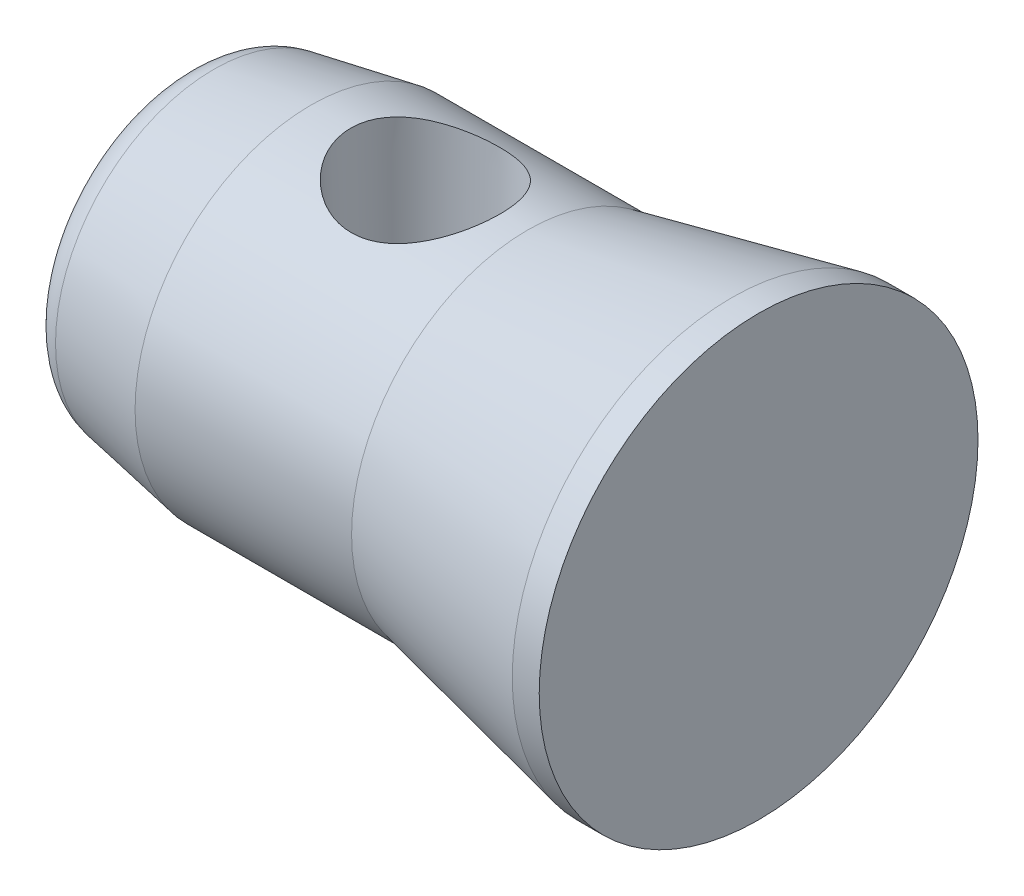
ISO-10303-21;
HEADER;
FILE_DESCRIPTION(('STEP AP214'),'2;1');
FILE_NAME('part.step','',(''),(''),'','','');
FILE_SCHEMA(('AUTOMOTIVE_DESIGN { 1 0 10303 214 1 1 1 1 }'));
ENDSEC;
DATA;
#1=APPLICATION_CONTEXT('core data for automotive mechanical design processes');
#2=APPLICATION_PROTOCOL_DEFINITION('international standard','automotive_design',2000,#1);
#3=PRODUCT_CONTEXT('',#1,'mechanical');
#4=PRODUCT('Part','Part','',(#3));
#5=PRODUCT_RELATED_PRODUCT_CATEGORY('part','',(#4));
#6=PRODUCT_DEFINITION_FORMATION('','',#4);
#7=PRODUCT_DEFINITION_CONTEXT('part definition',#1,'design');
#8=PRODUCT_DEFINITION('design','',#6,#7);
#9=PRODUCT_DEFINITION_SHAPE('','',#8);
#10=(LENGTH_UNIT() NAMED_UNIT(*) SI_UNIT(.MILLI.,.METRE.));
#11=(NAMED_UNIT(*) PLANE_ANGLE_UNIT() SI_UNIT($,.RADIAN.));
#12=(NAMED_UNIT(*) SI_UNIT($,.STERADIAN.) SOLID_ANGLE_UNIT());
#13=UNCERTAINTY_MEASURE_WITH_UNIT(LENGTH_MEASURE(1.E-05),#10,'distance_accuracy_value','');
#14=(GEOMETRIC_REPRESENTATION_CONTEXT(3) GLOBAL_UNCERTAINTY_ASSIGNED_CONTEXT((#13)) GLOBAL_UNIT_ASSIGNED_CONTEXT((#10,
#11,#12)) REPRESENTATION_CONTEXT('',''));
#15=CARTESIAN_POINT('',(0.,0.,0.));
#16=DIRECTION('',(0.,0.,1.));
#17=DIRECTION('',(1.,0.,0.));
#18=AXIS2_PLACEMENT_3D('',#15,#16,#17);
#19=CARTESIAN_POINT('',(-33.874,0.,0.));
#20=DIRECTION('',(1.,0.,0.));
#21=DIRECTION('',(0.,0.,-1.));
#22=AXIS2_PLACEMENT_3D('',#19,#20,#21);
#23=CONICAL_SURFACE('',#22,13.903,0.179210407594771);
#24=CARTESIAN_POINT('',(-41.5497580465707,0.,0.));
#25=DIRECTION('',(-1.,0.,0.));
#26=DIRECTION('',(0.,0.,1.));
#27=AXIS2_PLACEMENT_3D('',#24,#25,#26);
#28=CIRCLE('',#27,12.5125064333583);
#29=CARTESIAN_POINT('',(-41.5497580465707,0.,12.5125064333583));
#30=VERTEX_POINT('',#29);
#31=EDGE_CURVE('E96',#30,#30,#28,.T.);
#32=ORIENTED_EDGE('',*,*,#31,.F.);
#33=EDGE_LOOP('',(#32));
#34=FACE_BOUND('',#33,.T.);
#35=CARTESIAN_POINT('',(-33.874,0.,0.));
#36=DIRECTION('',(-1.,0.,0.));
#37=DIRECTION('',(0.,0.,1.));
#38=AXIS2_PLACEMENT_3D('',#35,#36,#37);
#39=CIRCLE('',#38,13.903);
#40=CARTESIAN_POINT('',(-33.874,0.,13.903));
#41=VERTEX_POINT('',#40);
#42=EDGE_CURVE('E10',#41,#41,#39,.T.);
#43=ORIENTED_EDGE('',*,*,#42,.T.);
#44=EDGE_LOOP('',(#43));
#45=FACE_BOUND('',#44,.T.);
#46=ADVANCED_FACE('F32',(#34,#45),#23,.T.);
#47=CARTESIAN_POINT('',(-110.,0.,0.));
#48=DIRECTION('',(-1.,0.,0.));
#49=DIRECTION('',(0.,0.,1.));
#50=AXIS2_PLACEMENT_3D('',#47,#48,#49);
#51=CYLINDRICAL_SURFACE('',#50,13.903);
#52=CARTESIAN_POINT('',(-28.1991654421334,-13.3648858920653,-3.8305657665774));
#53=CARTESIAN_POINT('',(-28.413769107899,-13.419504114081,-3.63999457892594));
#54=CARTESIAN_POINT('',(-28.6120570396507,-13.4748615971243,-3.43141943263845));
#55=CARTESIAN_POINT('',(-28.9713312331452,-13.5811070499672,-2.98326657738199));
#56=CARTESIAN_POINT('',(-29.1323246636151,-13.6319958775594,-2.74369484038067));
#57=CARTESIAN_POINT('',(-29.4126989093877,-13.7239453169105,-2.23888655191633));
#58=CARTESIAN_POINT('',(-29.5319955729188,-13.7649860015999,-1.97359946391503));
#59=CARTESIAN_POINT('',(-29.7243766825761,-13.8325328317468,-1.4250164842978));
#60=CARTESIAN_POINT('',(-29.7974767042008,-13.8590438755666,-1.14172669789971));
#61=CARTESIAN_POINT('',(-29.8926854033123,-13.8937950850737,-0.576903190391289));
#62=CARTESIAN_POINT('',(-29.9166543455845,-13.9027013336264,-0.295724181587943));
#63=CARTESIAN_POINT('',(-29.9182328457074,-13.9032835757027,0.26675457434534));
#64=CARTESIAN_POINT('',(-29.8958505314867,-13.8949625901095,0.548054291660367));
#65=CARTESIAN_POINT('',(-29.807218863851,-13.8625893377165,1.09268666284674));
#66=CARTESIAN_POINT('',(-29.7425023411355,-13.8390871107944,1.35630458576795));
#67=CARTESIAN_POINT('',(-29.5730038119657,-13.7792514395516,1.86875537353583));
#68=CARTESIAN_POINT('',(-29.4682166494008,-13.7429163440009,2.11758633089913));
#69=CARTESIAN_POINT('',(-29.2182174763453,-13.6597334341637,2.60136178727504));
#70=CARTESIAN_POINT('',(-29.0719348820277,-13.6126146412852,2.83570548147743));
#71=CARTESIAN_POINT('',(-28.7443015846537,-13.5131343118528,3.2771808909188));
#72=CARTESIAN_POINT('',(-28.5629382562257,-13.4607708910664,3.48430276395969));
#73=CARTESIAN_POINT('',(-28.15884080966,-13.3531752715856,3.87681376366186));
#74=CARTESIAN_POINT('',(-27.9344406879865,-13.297936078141,4.06050284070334));
#75=CARTESIAN_POINT('',(-27.5764137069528,-13.219727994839,4.30576374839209));
#76=CARTESIAN_POINT('',(-27.4534222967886,-13.1944203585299,4.38250782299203));
#77=CARTESIAN_POINT('',(-27.2009971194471,-13.1461113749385,4.5253552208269));
#78=CARTESIAN_POINT('',(-27.0715661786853,-13.1231090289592,4.59146315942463));
#79=CARTESIAN_POINT('',(-26.8075419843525,-13.0802160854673,4.71226668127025));
#80=CARTESIAN_POINT('',(-26.6729679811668,-13.0603150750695,4.76700066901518));
#81=CARTESIAN_POINT('',(-26.3992229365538,-13.024200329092,4.86480560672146));
#82=CARTESIAN_POINT('',(-26.2600539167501,-13.0079849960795,4.90788161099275));
#83=CARTESIAN_POINT('',(-25.9781534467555,-12.9798048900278,4.98193197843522));
#84=CARTESIAN_POINT('',(-25.8354231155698,-12.9678387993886,5.0129100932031));
#85=CARTESIAN_POINT('',(-25.5475110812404,-12.9485892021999,5.0624259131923));
#86=CARTESIAN_POINT('',(-25.4023295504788,-12.9413053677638,5.08096448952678));
#87=CARTESIAN_POINT('',(-25.120574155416,-12.9320169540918,5.10455608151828));
#88=CARTESIAN_POINT('',(-24.9840793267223,-12.9296897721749,5.11043347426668));
#89=CARTESIAN_POINT('',(-24.7110091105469,-12.9294214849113,5.11111244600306));
#90=CARTESIAN_POINT('',(-24.5744337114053,-12.9314818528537,5.10591030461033));
#91=CARTESIAN_POINT('',(-24.3023501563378,-12.9399214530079,5.08448355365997));
#92=CARTESIAN_POINT('',(-24.1668415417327,-12.9462987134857,5.06826397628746));
#93=CARTESIAN_POINT('',(-23.8977803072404,-12.9631627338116,5.02497353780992));
#94=CARTESIAN_POINT('',(-23.7642284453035,-12.9736510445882,4.99789858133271));
#95=CARTESIAN_POINT('',(-23.5037664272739,-12.99805636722,4.93407258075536));
#96=CARTESIAN_POINT('',(-23.376774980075,-13.0118692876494,4.8976133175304));
#97=CARTESIAN_POINT('',(-23.1263550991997,-13.0426557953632,4.81502580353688));
#98=CARTESIAN_POINT('',(-23.0029279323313,-13.0596304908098,4.76889416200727));
#99=CARTESIAN_POINT('',(-22.6391527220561,-13.1145996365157,4.61653475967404));
#100=CARTESIAN_POINT('',(-22.4051166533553,-13.1566584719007,4.49629445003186));
#101=CARTESIAN_POINT('',(-21.9471742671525,-13.249707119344,4.21447754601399));
#102=CARTESIAN_POINT('',(-21.724524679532,-13.3010598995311,4.05099775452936));
#103=CARTESIAN_POINT('',(-21.3085743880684,-13.4055871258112,3.6903613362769));
#104=CARTESIAN_POINT('',(-21.1152841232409,-13.4587622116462,3.4931927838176));
#105=CARTESIAN_POINT('',(-20.8459748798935,-13.5372849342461,3.16995324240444));
#106=CARTESIAN_POINT('',(-20.7576496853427,-13.5639261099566,3.05422170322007));
#107=CARTESIAN_POINT('',(-20.591037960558,-13.6154987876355,2.8154033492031));
#108=CARTESIAN_POINT('',(-20.5127477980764,-13.6404309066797,2.69231921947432));
#109=CARTESIAN_POINT('',(-20.3667669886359,-13.6879015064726,2.43953069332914));
#110=CARTESIAN_POINT('',(-20.299079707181,-13.7104392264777,2.30982421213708));
#111=CARTESIAN_POINT('',(-20.1749121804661,-13.7524700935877,2.04474209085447));
#112=CARTESIAN_POINT('',(-20.1184269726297,-13.7719645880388,1.90936899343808));
#113=CARTESIAN_POINT('',(-20.0180334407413,-13.8070479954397,1.63629130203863));
#114=CARTESIAN_POINT('',(-19.9739209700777,-13.8226996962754,1.49866987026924));
#115=CARTESIAN_POINT('',(-19.8974039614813,-13.8500864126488,1.2198858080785));
#116=CARTESIAN_POINT('',(-19.8649945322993,-13.8618230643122,1.07872468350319));
#117=CARTESIAN_POINT('',(-19.8121894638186,-13.8810480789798,0.793903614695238));
#118=CARTESIAN_POINT('',(-19.7917923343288,-13.8885369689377,0.650243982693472));
#119=CARTESIAN_POINT('',(-19.7632227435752,-13.8990484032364,0.361554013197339));
#120=CARTESIAN_POINT('',(-19.7550497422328,-13.9020711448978,0.216523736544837));
#121=CARTESIAN_POINT('',(-19.751122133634,-13.9035224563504,-0.0659925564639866));
#122=CARTESIAN_POINT('',(-19.7547292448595,-13.9021871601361,-0.203468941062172));
#123=CARTESIAN_POINT('',(-19.7729441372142,-13.8954697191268,-0.477638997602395));
#124=CARTESIAN_POINT('',(-19.7875556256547,-13.8900862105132,-0.614332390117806));
#125=CARTESIAN_POINT('',(-19.8276354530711,-13.8754157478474,-0.885846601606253));
#126=CARTESIAN_POINT('',(-19.8530994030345,-13.8661303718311,-1.02066815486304));
#127=CARTESIAN_POINT('',(-19.914657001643,-13.8438952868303,-1.28760262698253));
#128=CARTESIAN_POINT('',(-19.9507546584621,-13.8309441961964,-1.41971450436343));
#129=CARTESIAN_POINT('',(-20.0329914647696,-13.8018059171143,-1.67943990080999));
#130=CARTESIAN_POINT('',(-20.0790626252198,-13.7856406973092,-1.80707739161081));
#131=CARTESIAN_POINT('',(-20.18100508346,-13.7504258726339,-2.05798067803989));
#132=CARTESIAN_POINT('',(-20.2368798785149,-13.7313752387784,-2.18124489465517));
#133=CARTESIAN_POINT('',(-20.4185987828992,-13.6705771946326,-2.54330749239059));
#134=CARTESIAN_POINT('',(-20.5586010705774,-13.6251601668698,-2.77457553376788));
#135=CARTESIAN_POINT('',(-20.880097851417,-13.5265383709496,-3.22200993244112));
#136=CARTESIAN_POINT('',(-21.0632804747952,-13.4730621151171,-3.4368930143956));
#137=CARTESIAN_POINT('',(-21.4626597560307,-13.365574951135,-3.83367755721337));
#138=CARTESIAN_POINT('',(-21.678867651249,-13.3115638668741,-4.01556774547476));
#139=CARTESIAN_POINT('',(-22.0279876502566,-13.2336468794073,-4.26284631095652));
#140=CARTESIAN_POINT('',(-22.1508419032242,-13.2077741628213,-4.34214232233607));
#141=CARTESIAN_POINT('',(-22.403251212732,-13.1582421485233,-4.49000463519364));
#142=CARTESIAN_POINT('',(-22.5328035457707,-13.1345819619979,-4.55857525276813));
#143=CARTESIAN_POINT('',(-22.797793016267,-13.0902316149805,-4.68441067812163));
#144=CARTESIAN_POINT('',(-22.93323092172,-13.0695418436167,-4.74167400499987));
#145=CARTESIAN_POINT('',(-23.2089705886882,-13.0318457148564,-4.84431595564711));
#146=CARTESIAN_POINT('',(-23.3492699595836,-13.0148375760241,-4.88970032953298));
#147=CARTESIAN_POINT('',(-23.627972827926,-12.9857013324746,-4.9665471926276));
#148=CARTESIAN_POINT('',(-23.7662240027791,-12.9734038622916,-4.99849796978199));
#149=CARTESIAN_POINT('',(-24.0451775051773,-12.953175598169,-5.05068674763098));
#150=CARTESIAN_POINT('',(-24.1858787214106,-12.9452428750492,-5.07092992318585));
#151=CARTESIAN_POINT('',(-24.4686396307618,-12.9340189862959,-5.09949000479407));
#152=CARTESIAN_POINT('',(-24.610699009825,-12.9307267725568,-5.10780960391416));
#153=CARTESIAN_POINT('',(-24.8950413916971,-12.9288999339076,-5.11243220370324));
#154=CARTESIAN_POINT('',(-25.0373243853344,-12.9303651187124,-5.10873568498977));
#155=CARTESIAN_POINT('',(-25.3119864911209,-12.9377571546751,-5.08998419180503));
#156=CARTESIAN_POINT('',(-25.4444240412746,-12.9433966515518,-5.07566062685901));
#157=CARTESIAN_POINT('',(-25.707575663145,-12.9586274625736,-5.03664785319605));
#158=CARTESIAN_POINT('',(-25.8382891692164,-12.9682200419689,-5.01195532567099));
#159=CARTESIAN_POINT('',(-26.0970506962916,-12.9910624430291,-4.95244575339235));
#160=CARTESIAN_POINT('',(-26.2250989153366,-13.0043119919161,-4.91762946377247));
#161=CARTESIAN_POINT('',(-26.4777712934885,-13.0340812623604,-4.83817459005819));
#162=CARTESIAN_POINT('',(-26.6023939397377,-13.0506024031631,-4.79353174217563));
#163=CARTESIAN_POINT('',(-26.8602796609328,-13.0883263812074,-4.68961477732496));
#164=CARTESIAN_POINT('',(-26.9930790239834,-13.1098384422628,-4.62929746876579));
#165=CARTESIAN_POINT('',(-27.2526547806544,-13.1555739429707,-4.49768167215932));
#166=CARTESIAN_POINT('',(-27.3794282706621,-13.1797986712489,-4.42637795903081));
#167=CARTESIAN_POINT('',(-27.7494618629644,-13.2554136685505,-4.19682582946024));
#168=CARTESIAN_POINT('',(-27.9826198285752,-13.3097734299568,-4.02286143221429));
#169=CARTESIAN_POINT('',(-28.1991654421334,-13.3648858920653,-3.8305657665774));
#170=B_SPLINE_CURVE_WITH_KNOTS('',3,(#52,#53,#54,#55,#56,#57,#58,#59,#60,#61,#62,#63,#64,#65,
#66,#67,#68,#69,#70,#71,#72,#73,#74,#75,#76,#77,#78,#79,#80,#81,#82,#83,#84,#85,#86,#87,#88,#89,
#90,#91,#92,#93,#94,#95,#96,#97,#98,#99,#100,#101,#102,#103,#104,#105,#106,#107,#108,#109,#110,
#111,#112,#113,#114,#115,#116,#117,#118,#119,#120,#121,#122,#123,#124,#125,#126,#127,#128,#129,
#130,#131,#132,#133,#134,#135,#136,#137,#138,#139,#140,#141,#142,#143,#144,#145,#146,#147,#148,
#149,#150,#151,#152,#153,#154,#155,#156,#157,#158,#159,#160,#161,#162,#163,#164,#165,#166,#167,
#168,#169),.UNSPECIFIED.,.T.,.F.,(4,2,2,2,2,2,2,2,2,2,2,2,2,2,2,2,2,2,2,2,2,2,2,2,2,2,2,2,2,2,2,
2,2,2,2,2,2,2,2,2,2,2,2,2,2,2,2,2,2,2,2,2,2,2,2,2,2,2,4),(0.,0.875298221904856,1.75042805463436,
2.62731399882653,3.50390413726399,4.34664020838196,5.18922851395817,6.00288154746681,
6.8166393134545,7.65367397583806,8.49101044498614,9.37207955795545,9.81312858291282,
10.2539857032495,10.6933291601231,11.1324818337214,11.5714982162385,12.0104838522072,
12.4198951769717,12.8294439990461,13.2388058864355,13.6483223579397,14.0463861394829,
14.444589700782,15.2404004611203,16.0797949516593,16.9194872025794,17.3630528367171,
17.8064574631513,18.2500025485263,18.6933507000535,19.1288837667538,19.5642345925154,
19.9995313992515,20.434808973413,20.8469013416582,21.259132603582,21.6711973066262,
22.0834175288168,22.4929115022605,22.9025518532,23.7212071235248,24.5797162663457,
25.4385181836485,25.8835413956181,26.328385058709,26.7732869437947,27.2179730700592,
27.6446974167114,28.0712330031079,28.4976722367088,28.9240944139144,29.323610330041,
29.7232542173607,30.122868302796,30.5226561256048,30.9643529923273,31.4062605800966,
32.2894793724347),.UNSPECIFIED.);
#171=CARTESIAN_POINT('',(-28.1991654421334,-13.3648858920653,-3.8305657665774));
#172=VERTEX_POINT('',#171);
#173=EDGE_CURVE('E35',#172,#172,#170,.T.);
#174=ORIENTED_EDGE('',*,*,#173,.T.);
#175=EDGE_LOOP('',(#174));
#176=FACE_BOUND('',#175,.T.);
#177=CARTESIAN_POINT('',(-28.7915002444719,13.2088863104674,-4.33805618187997));
#178=CARTESIAN_POINT('',(-28.5501406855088,13.1375139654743,-4.55537040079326));
#179=CARTESIAN_POINT('',(-28.2903382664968,13.0666422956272,-4.75301699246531));
#180=CARTESIAN_POINT('',(-27.739392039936,12.933635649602,-5.10391884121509));
#181=CARTESIAN_POINT('',(-27.4481799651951,12.8715204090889,-5.25707462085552));
#182=CARTESIAN_POINT('',(-26.9932200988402,12.7905815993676,-5.44970203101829));
#183=CARTESIAN_POINT('',(-26.8382408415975,12.7656063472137,-5.50779938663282));
#184=CARTESIAN_POINT('',(-26.5233289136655,12.7205992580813,-5.61096672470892));
#185=CARTESIAN_POINT('',(-26.3633982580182,12.7005654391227,-5.65604193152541));
#186=CARTESIAN_POINT('',(-26.039878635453,12.6661693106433,-5.73265440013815));
#187=CARTESIAN_POINT('',(-25.8762929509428,12.6518021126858,-5.76420333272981));
#188=CARTESIAN_POINT('',(-25.5466291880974,12.6292492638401,-5.81345089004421));
#189=CARTESIAN_POINT('',(-25.380551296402,12.6210631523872,-5.83115054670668));
#190=CARTESIAN_POINT('',(-25.0575510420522,12.6114901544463,-5.85182384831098));
#191=CARTESIAN_POINT('',(-24.9006931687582,12.6097163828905,-5.85563553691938));
#192=CARTESIAN_POINT('',(-24.5871537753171,12.6119502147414,-5.85082293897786));
#193=CARTESIAN_POINT('',(-24.4304723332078,12.6159597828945,-5.8421944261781));
#194=CARTESIAN_POINT('',(-24.1185769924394,12.6296243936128,-5.81259495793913));
#195=CARTESIAN_POINT('',(-23.9633626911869,12.6392778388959,-5.79162749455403));
#196=CARTESIAN_POINT('',(-23.655433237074,12.6639072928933,-5.73757274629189));
#197=CARTESIAN_POINT('',(-23.5027190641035,12.6788853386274,-5.7044808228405));
#198=CARTESIAN_POINT('',(-23.2051148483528,12.7131915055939,-5.62760067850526));
#199=CARTESIAN_POINT('',(-23.0601254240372,12.7323863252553,-5.58413730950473));
#200=CARTESIAN_POINT('',(-22.7743999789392,12.774780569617,-5.48645766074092));
#201=CARTESIAN_POINT('',(-22.6336654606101,12.7979813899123,-5.4322376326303));
#202=CARTESIAN_POINT('',(-22.2190881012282,12.8726404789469,-5.25406202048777));
#203=CARTESIAN_POINT('',(-21.9526659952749,12.9291804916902,-5.11453734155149));
#204=CARTESIAN_POINT('',(-21.4276516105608,13.0542670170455,-4.78668605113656));
#205=CARTESIAN_POINT('',(-21.1709183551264,13.1233774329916,-4.59562343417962));
#206=CARTESIAN_POINT('',(-20.6917923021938,13.2633262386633,-4.1745250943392));
#207=CARTESIAN_POINT('',(-20.4694141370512,13.3341653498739,-3.94447285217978));
#208=CARTESIAN_POINT('',(-20.1599039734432,13.4383296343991,-3.56695388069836));
#209=CARTESIAN_POINT('',(-20.0583767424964,13.4736194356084,-3.43157580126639));
#210=CARTESIAN_POINT('',(-19.8671850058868,13.541719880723,-3.15212206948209));
#211=CARTESIAN_POINT('',(-19.7775158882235,13.574531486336,-3.00804983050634));
#212=CARTESIAN_POINT('',(-19.6107696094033,13.6367530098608,-2.71205786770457));
#213=CARTESIAN_POINT('',(-19.5336949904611,13.6661622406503,-2.56013656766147));
#214=CARTESIAN_POINT('',(-19.392918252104,13.7207043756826,-2.24955915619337));
#215=CARTESIAN_POINT('',(-19.3292095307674,13.7458393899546,-2.09090641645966));
#216=CARTESIAN_POINT('',(-19.2180497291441,13.7901963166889,-1.77437691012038));
#217=CARTESIAN_POINT('',(-19.1700543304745,13.8096131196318,-1.61671865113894));
#218=CARTESIAN_POINT('',(-19.0875201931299,13.8432581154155,-1.29744477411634));
#219=CARTESIAN_POINT('',(-19.0529753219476,13.8574886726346,-1.13583099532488));
#220=CARTESIAN_POINT('',(-18.9977227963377,13.880351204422,-0.809901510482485));
#221=CARTESIAN_POINT('',(-18.9770117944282,13.8889845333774,-0.645586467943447));
#222=CARTESIAN_POINT('',(-18.9496696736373,13.9003978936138,-0.31559006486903));
#223=CARTESIAN_POINT('',(-18.9430377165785,13.9031782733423,-0.149908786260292));
#224=CARTESIAN_POINT('',(-18.9438999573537,13.9028176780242,0.169201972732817));
#225=CARTESIAN_POINT('',(-18.9503904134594,13.9000974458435,0.32263571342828));
#226=CARTESIAN_POINT('',(-18.975454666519,13.8896341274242,0.628392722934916));
#227=CARTESIAN_POINT('',(-18.9940324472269,13.8818893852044,0.780715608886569));
#228=CARTESIAN_POINT('',(-19.0430697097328,13.8615790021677,1.08304345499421));
#229=CARTESIAN_POINT('',(-19.073524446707,13.8490152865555,1.23304931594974));
#230=CARTESIAN_POINT('',(-19.1460204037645,13.8193802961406,1.52983357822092));
#231=CARTESIAN_POINT('',(-19.1880660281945,13.802307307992,1.67661072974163));
#232=CARTESIAN_POINT('',(-19.2831203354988,13.7641664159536,1.96525184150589));
#233=CARTESIAN_POINT('',(-19.3360758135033,13.7431179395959,2.10713588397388));
#234=CARTESIAN_POINT('',(-19.4526112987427,13.697477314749,2.38589962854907));
#235=CARTESIAN_POINT('',(-19.5161950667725,13.6728839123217,2.52277753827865));
#236=CARTESIAN_POINT('',(-19.722156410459,13.5946248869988,2.92469749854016));
#237=CARTESIAN_POINT('',(-19.8798116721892,13.5364523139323,3.18122948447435));
#238=CARTESIAN_POINT('',(-20.2433677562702,13.4091202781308,3.68244790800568));
#239=CARTESIAN_POINT('',(-20.4518174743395,13.339483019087,3.92514752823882));
#240=CARTESIAN_POINT('',(-20.90536029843,13.1992337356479,4.37365654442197));
#241=CARTESIAN_POINT('',(-21.1504716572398,13.1286212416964,4.57944745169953));
#242=CARTESIAN_POINT('',(-21.5487723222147,13.0255496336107,4.86202999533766));
#243=CARTESIAN_POINT('',(-21.6908886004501,12.9907835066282,4.95393089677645));
#244=CARTESIAN_POINT('',(-21.9829732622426,12.9240820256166,5.12542327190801));
#245=CARTESIAN_POINT('',(-22.1329385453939,12.892145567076,5.20501955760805));
#246=CARTESIAN_POINT('',(-22.4398166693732,12.8321334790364,5.35126310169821));
#247=CARTESIAN_POINT('',(-22.5967303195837,12.8040583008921,5.41790884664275));
#248=CARTESIAN_POINT('',(-22.9163578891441,12.7527560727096,5.53758635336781));
#249=CARTESIAN_POINT('',(-23.0790688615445,12.729526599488,5.59062492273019));
#250=CARTESIAN_POINT('',(-23.4028096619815,12.6895378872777,5.68079025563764));
#251=CARTESIAN_POINT('',(-23.5636647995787,12.6725647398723,5.71844907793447));
#252=CARTESIAN_POINT('',(-23.8883886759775,12.6444961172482,5.78024935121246));
#253=CARTESIAN_POINT('',(-24.0522560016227,12.6333979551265,5.80439698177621));
#254=CARTESIAN_POINT('',(-24.3816953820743,12.617487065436,5.8389033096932));
#255=CARTESIAN_POINT('',(-24.5472669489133,12.6126725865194,5.849265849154));
#256=CARTESIAN_POINT('',(-24.8787536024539,12.6095093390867,5.85608228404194));
#257=CARTESIAN_POINT('',(-25.0446686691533,12.6111602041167,5.85253696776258));
#258=CARTESIAN_POINT('',(-25.3627097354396,12.6204876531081,5.83239283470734));
#259=CARTESIAN_POINT('',(-25.5149158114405,12.6276915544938,5.81681780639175));
#260=CARTESIAN_POINT('',(-25.817390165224,12.6473198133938,5.77401634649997));
#261=CARTESIAN_POINT('',(-25.9676577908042,12.6597458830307,5.74678609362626));
#262=CARTESIAN_POINT('',(-26.2651505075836,12.6894234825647,5.68095421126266));
#263=CARTESIAN_POINT('',(-26.4123763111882,12.7066738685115,5.64235527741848));
#264=CARTESIAN_POINT('',(-26.7029557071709,12.7454873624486,5.55412294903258));
#265=CARTESIAN_POINT('',(-26.8463077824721,12.7670521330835,5.50448529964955));
#266=CARTESIAN_POINT('',(-27.1304221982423,12.8142316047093,5.39375121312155));
#267=CARTESIAN_POINT('',(-27.271110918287,12.839903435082,5.3324904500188));
#268=CARTESIAN_POINT('',(-27.5468627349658,12.8943434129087,5.19946925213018));
#269=CARTESIAN_POINT('',(-27.6819239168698,12.9231126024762,5.12770528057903));
#270=CARTESIAN_POINT('',(-27.9457066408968,12.9829856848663,4.97416125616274));
#271=CARTESIAN_POINT('',(-28.0744272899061,13.0140899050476,4.89237979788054));
#272=CARTESIAN_POINT('',(-28.3248919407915,13.0778521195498,4.71929005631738));
#273=CARTESIAN_POINT('',(-28.4466355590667,13.1105101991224,4.62798124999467));
#274=CARTESIAN_POINT('',(-28.6922416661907,13.1793090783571,4.4284588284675));
#275=CARTESIAN_POINT('',(-28.8154593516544,13.2155158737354,4.31947298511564));
#276=CARTESIAN_POINT('',(-29.0522985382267,13.2878401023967,4.09157677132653));
#277=CARTESIAN_POINT('',(-29.1659228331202,13.3239575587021,3.97266931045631));
#278=CARTESIAN_POINT('',(-29.3829908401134,13.3951784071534,3.72547392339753));
#279=CARTESIAN_POINT('',(-29.4864282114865,13.4302811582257,3.59718024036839));
#280=CARTESIAN_POINT('',(-29.6823020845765,13.498506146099,3.33203691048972));
#281=CARTESIAN_POINT('',(-29.7747430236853,13.5316291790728,3.19519074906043));
#282=CARTESIAN_POINT('',(-29.9498873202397,13.5957260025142,2.91056446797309));
#283=CARTESIAN_POINT('',(-30.0323305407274,13.6266361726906,2.76260962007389));
#284=CARTESIAN_POINT('',(-30.1842739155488,13.6845846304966,2.45954072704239));
#285=CARTESIAN_POINT('',(-30.2537794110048,13.7116245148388,2.30442966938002));
#286=CARTESIAN_POINT('',(-30.3791743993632,13.7610469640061,1.98811711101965));
#287=CARTESIAN_POINT('',(-30.4350672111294,13.7834306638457,1.82691710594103));
#288=CARTESIAN_POINT('',(-30.5326287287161,13.8228673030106,1.49963494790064));
#289=CARTESIAN_POINT('',(-30.5742985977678,13.8399206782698,1.33355319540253));
#290=CARTESIAN_POINT('',(-30.6406023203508,13.8672149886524,1.00917950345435));
#291=CARTESIAN_POINT('',(-30.6661933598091,13.877836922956,0.851114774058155));
#292=CARTESIAN_POINT('',(-30.7042748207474,13.8936853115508,0.533149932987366));
#293=CARTESIAN_POINT('',(-30.7167660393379,13.898912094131,0.37324993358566));
#294=CARTESIAN_POINT('',(-30.7285007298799,13.9038215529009,0.0529398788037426));
#295=CARTESIAN_POINT('',(-30.7277491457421,13.9035062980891,-0.107469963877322));
#296=CARTESIAN_POINT('',(-30.7130191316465,13.8973456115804,-0.427571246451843));
#297=CARTESIAN_POINT('',(-30.6990410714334,13.8915003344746,-0.587262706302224));
#298=CARTESIAN_POINT('',(-30.6591502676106,13.8749147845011,-0.895944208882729));
#299=CARTESIAN_POINT('',(-30.6339348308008,13.8644608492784,-1.04504046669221));
#300=CARTESIAN_POINT('',(-30.5720826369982,13.8390197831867,-1.34049864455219));
#301=CARTESIAN_POINT('',(-30.5354420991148,13.8240311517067,-1.4868596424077));
#302=CARTESIAN_POINT('',(-30.451074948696,13.7898800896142,-1.77589103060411));
#303=CARTESIAN_POINT('',(-30.4033457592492,13.7707166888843,-1.91856055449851));
#304=CARTESIAN_POINT('',(-30.2972285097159,13.7286757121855,-2.1993337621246));
#305=CARTESIAN_POINT('',(-30.2388366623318,13.7057968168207,-2.33743580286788));
#306=CARTESIAN_POINT('',(-30.0445178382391,13.6308781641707,-2.75185284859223));
#307=CARTESIAN_POINT('',(-29.8919743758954,13.5736185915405,-3.01963025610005));
#308=CARTESIAN_POINT('',(-29.5482450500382,13.450914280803,-3.5262278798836));
#309=CARTESIAN_POINT('',(-29.3571276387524,13.3854841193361,-3.76509820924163));
#310=CARTESIAN_POINT('',(-29.0920108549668,13.3007002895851,-4.04831484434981));
#311=CARTESIAN_POINT('',(-29.0336438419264,13.2823593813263,-4.10805241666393));
#312=CARTESIAN_POINT('',(-28.9144245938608,13.2456300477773,-4.22497901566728));
#313=CARTESIAN_POINT('',(-28.8535723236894,13.2272416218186,-4.28216800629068));
#314=CARTESIAN_POINT('',(-28.7915002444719,13.2088863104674,-4.33805618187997));
#315=B_SPLINE_CURVE_WITH_KNOTS('',3,(#177,#178,#179,#180,#181,#182,#183,#184,#185,#186,#187,
#188,#189,#190,#191,#192,#193,#194,#195,#196,#197,#198,#199,#200,#201,#202,#203,#204,#205,#206,
#207,#208,#209,#210,#211,#212,#213,#214,#215,#216,#217,#218,#219,#220,#221,#222,#223,#224,#225,
#226,#227,#228,#229,#230,#231,#232,#233,#234,#235,#236,#237,#238,#239,#240,#241,#242,#243,#244,
#245,#246,#247,#248,#249,#250,#251,#252,#253,#254,#255,#256,#257,#258,#259,#260,#261,#262,#263,
#264,#265,#266,#267,#268,#269,#270,#271,#272,#273,#274,#275,#276,#277,#278,#279,#280,#281,#282,
#283,#284,#285,#286,#287,#288,#289,#290,#291,#292,#293,#294,#295,#296,#297,#298,#299,#300,#301,
#302,#303,#304,#305,#306,#307,#308,#309,#310,#311,#312,#313,#314),.UNSPECIFIED.,.T.,.F.,(4,2,2,
2,2,2,2,2,2,2,2,2,2,2,2,2,2,2,2,2,2,2,2,2,2,2,2,2,2,2,2,2,2,2,2,2,2,2,2,2,2,2,2,2,2,2,2,2,2,2,2,
2,2,2,2,2,2,2,2,2,2,2,2,2,2,2,2,2,4),(0.,0.997290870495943,1.99679472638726,2.49839823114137,
2.99980021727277,3.50076870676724,4.00169986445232,4.47185016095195,4.94216021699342,
5.41233723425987,5.8826943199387,6.33990346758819,6.79727221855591,7.71137548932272,
8.6895766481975,9.66819329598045,10.1862362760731,10.7040771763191,11.222022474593,
11.7397113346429,12.2368802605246,12.7338222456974,13.2306439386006,13.727436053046,
14.187664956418,14.6480456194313,15.1082425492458,15.5686145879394,16.0267924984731,
16.4851328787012,17.4011715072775,18.379404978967,19.3581271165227,19.8759234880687,
20.3935168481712,20.9111706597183,21.4285649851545,21.9261239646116,22.4234551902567,
22.9206477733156,23.4178121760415,23.8767808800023,24.3359001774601,24.7949106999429,
25.2540984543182,25.7203407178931,26.1867403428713,26.6532054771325,27.1196962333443,
27.6244378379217,28.1290319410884,28.6339381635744,29.1386399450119,29.6544878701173,
30.1701223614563,30.6856310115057,31.2010974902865,31.6819002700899,32.1626737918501,
32.6432678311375,33.1238484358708,33.578046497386,34.0323950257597,34.4868492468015,
34.9414652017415,35.877596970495,36.8120818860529,37.0685583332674,37.3250384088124),.UNSPECIFIED.);
#316=CARTESIAN_POINT('',(-28.7915002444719,13.2088863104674,-4.33805618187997));
#317=VERTEX_POINT('',#316);
#318=EDGE_CURVE('E53',#317,#317,#315,.T.);
#319=ORIENTED_EDGE('',*,*,#318,.T.);
#320=EDGE_LOOP('',(#319));
#321=FACE_BOUND('',#320,.T.);
#322=ORIENTED_EDGE('',*,*,#42,.F.);
#323=EDGE_LOOP('',(#322));
#324=FACE_BOUND('',#323,.T.);
#325=CARTESIAN_POINT('',(-16.762,0.,0.));
#326=DIRECTION('',(-1.,0.,0.));
#327=DIRECTION('',(0.,0.,1.));
#328=AXIS2_PLACEMENT_3D('',#325,#326,#327);
#329=CIRCLE('',#328,13.903);
#330=CARTESIAN_POINT('',(-16.762,0.,13.903));
#331=VERTEX_POINT('',#330);
#332=EDGE_CURVE('E43',#331,#331,#329,.T.);
#333=ORIENTED_EDGE('',*,*,#332,.T.);
#334=EDGE_LOOP('',(#333));
#335=FACE_BOUND('',#334,.T.);
#336=ADVANCED_FACE('F57',(#176,#321,#324,#335),#51,.T.);
#337=CARTESIAN_POINT('',(-0.630670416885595,0.,0.));
#338=DIRECTION('',(1.,0.,0.));
#339=DIRECTION('',(0.,0.,-1.));
#340=AXIS2_PLACEMENT_3D('',#337,#338,#339);
#341=CONICAL_SURFACE('',#340,17.338,0.209806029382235);
#342=ORIENTED_EDGE('',*,*,#332,.F.);
#343=EDGE_LOOP('',(#342));
#344=FACE_BOUND('',#343,.T.);
#345=CARTESIAN_POINT('',(-0.630670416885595,0.,0.));
#346=DIRECTION('',(-1.,0.,0.));
#347=DIRECTION('',(0.,0.,1.));
#348=AXIS2_PLACEMENT_3D('',#345,#346,#347);
#349=CIRCLE('',#348,17.338);
#350=CARTESIAN_POINT('',(-0.630670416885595,0.,17.338));
#351=VERTEX_POINT('',#350);
#352=EDGE_CURVE('E50',#351,#351,#349,.T.);
#353=ORIENTED_EDGE('',*,*,#352,.T.);
#354=EDGE_LOOP('',(#353));
#355=FACE_BOUND('',#354,.T.);
#356=ADVANCED_FACE('F80',(#344,#355),#341,.T.);
#357=CARTESIAN_POINT('',(-110.,0.,0.));
#358=DIRECTION('',(-1.,0.,0.));
#359=DIRECTION('',(0.,0.,1.));
#360=AXIS2_PLACEMENT_3D('',#357,#358,#359);
#361=CYLINDRICAL_SURFACE('',#360,17.338);
#362=ORIENTED_EDGE('',*,*,#352,.F.);
#363=EDGE_LOOP('',(#362));
#364=FACE_BOUND('',#363,.T.);
#365=CARTESIAN_POINT('',(1.5,0.,0.));
#366=DIRECTION('',(-1.,0.,0.));
#367=DIRECTION('',(0.,0.,1.));
#368=AXIS2_PLACEMENT_3D('',#365,#366,#367);
#369=CIRCLE('',#368,17.338);
#370=CARTESIAN_POINT('',(1.5,0.,17.338));
#371=VERTEX_POINT('',#370);
#372=EDGE_CURVE('E104',#371,#371,#369,.T.);
#373=ORIENTED_EDGE('',*,*,#372,.T.);
#374=EDGE_LOOP('',(#373));
#375=FACE_BOUND('',#374,.T.);
#376=ADVANCED_FACE('F77',(#364,#375),#361,.T.);
#377=CARTESIAN_POINT('',(1.5,17.338,0.));
#378=DIRECTION('',(-1.,0.,0.));
#379=DIRECTION('',(0.,0.,1.));
#380=AXIS2_PLACEMENT_3D('',#377,#378,#379);
#381=PLANE('',#380);
#382=ORIENTED_EDGE('',*,*,#372,.F.);
#383=EDGE_LOOP('',(#382));
#384=FACE_BOUND('',#383,.T.);
#385=ADVANCED_FACE('F73',(#384),#381,.F.);
#386=CARTESIAN_POINT('',(-44.015,0.,0.));
#387=DIRECTION('',(1.,0.,0.));
#388=DIRECTION('',(0.,0.,-1.));
#389=AXIS2_PLACEMENT_3D('',#386,#387,#388);
#390=PLANE('',#389);
#391=CARTESIAN_POINT('',(-44.015,0.,0.));
#392=DIRECTION('',(-1.,0.,0.));
#393=DIRECTION('',(0.,0.,1.));
#394=AXIS2_PLACEMENT_3D('',#391,#392,#393);
#395=CIRCLE('',#394,9.5605521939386);
#396=CARTESIAN_POINT('',(-44.015,0.,9.5605521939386));
#397=VERTEX_POINT('',#396);
#398=EDGE_CURVE('E99',#397,#397,#395,.T.);
#399=ORIENTED_EDGE('',*,*,#398,.T.);
#400=EDGE_LOOP('',(#399));
#401=FACE_BOUND('',#400,.T.);
#402=ADVANCED_FACE('F69',(#401),#390,.F.);
#403=CARTESIAN_POINT('',(-41.015,0.,0.));
#404=DIRECTION('',(-1.,0.,0.));
#405=DIRECTION('',(0.,0.,1.));
#406=AXIS2_PLACEMENT_3D('',#403,#404,#405);
#407=TOROIDAL_SURFACE('',#406,9.56055219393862,3.);
#408=ORIENTED_EDGE('',*,*,#398,.F.);
#409=EDGE_LOOP('',(#408));
#410=FACE_BOUND('',#409,.T.);
#411=ORIENTED_EDGE('',*,*,#31,.T.);
#412=EDGE_LOOP('',(#411));
#413=FACE_BOUND('',#412,.T.);
#414=ADVANCED_FACE('F64',(#410,#413),#407,.T.);
#415=CARTESIAN_POINT('',(-24.835,20.,0.));
#416=DIRECTION('',(0.,1.,0.));
#417=DIRECTION('',(0.,0.,1.));
#418=AXIS2_PLACEMENT_3D('',#415,#416,#417);
#419=CONICAL_SURFACE('',#418,6.06894056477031,0.0290888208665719);
#420=ORIENTED_EDGE('',*,*,#318,.F.);
#421=EDGE_LOOP('',(#420));
#422=FACE_BOUND('',#421,.T.);
#423=ORIENTED_EDGE('',*,*,#173,.F.);
#424=EDGE_LOOP('',(#423));
#425=FACE_BOUND('',#424,.T.);
#426=ADVANCED_FACE('F60',(#422,#425),#419,.F.);
#427=CLOSED_SHELL('',(#46,#336,#356,#376,#385,#402,#414,#426));
#428=MANIFOLD_SOLID_BREP('B2',#427);
#429=ADVANCED_BREP_SHAPE_REPRESENTATION('',(#18,#428),#14);
#430=SHAPE_DEFINITION_REPRESENTATION(#9,#429);
ENDSEC;
END-ISO-10303-21;
